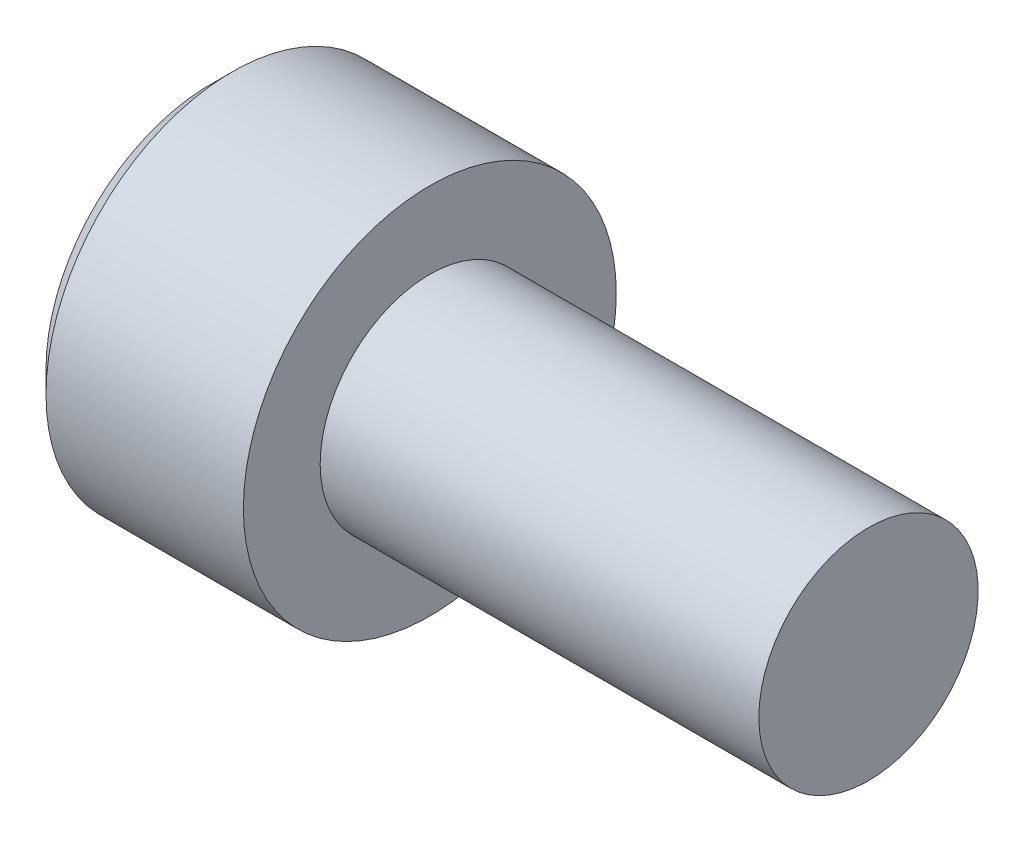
from build123d import *

# Parameters (mm, degrees)
CUT_EXTRUDE1_DEPTH = 2.5
CHAMFER1_SIZE      = 0.5


with BuildPart() as part:
    # Sketch1 → Revolve1 (revolve)
    with BuildSketch(Plane.XY, mode=Mode.PRIVATE) as revolve1_sk:
        Polygon((0, 2.5), (10, 2.5), (10, 0), (-5, 0), (-5, 4.25), (0, 4.25), align=None)
    revolve(revolve1_sk.sketch.rotate(Axis((-5, 0, 0), (1, 0, 0)), 90), axis=Axis((-5, 0, 0), (1, 0, 0)))

    # Sketch2 → Cut-Extrude1 (cut)
    with BuildSketch(Plane.ZY.offset(5)):
        Polygon((2, 1.154700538), (0, 2.309401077), (-2, 1.154700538), (-2, -1.154700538), (0, -2.309401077), (2, -1.154700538), align=None)
    extrude(amount=-CUT_EXTRUDE1_DEPTH, mode=Mode.SUBTRACT)

    # Chamfer1
    chamfer1_edges = [part.edges().sort_by_distance(p)[0] for p in [
        (-5, 0, -4.25),
    ]]
    chamfer(chamfer1_edges, length=CHAMFER1_SIZE)


solid = part.part
